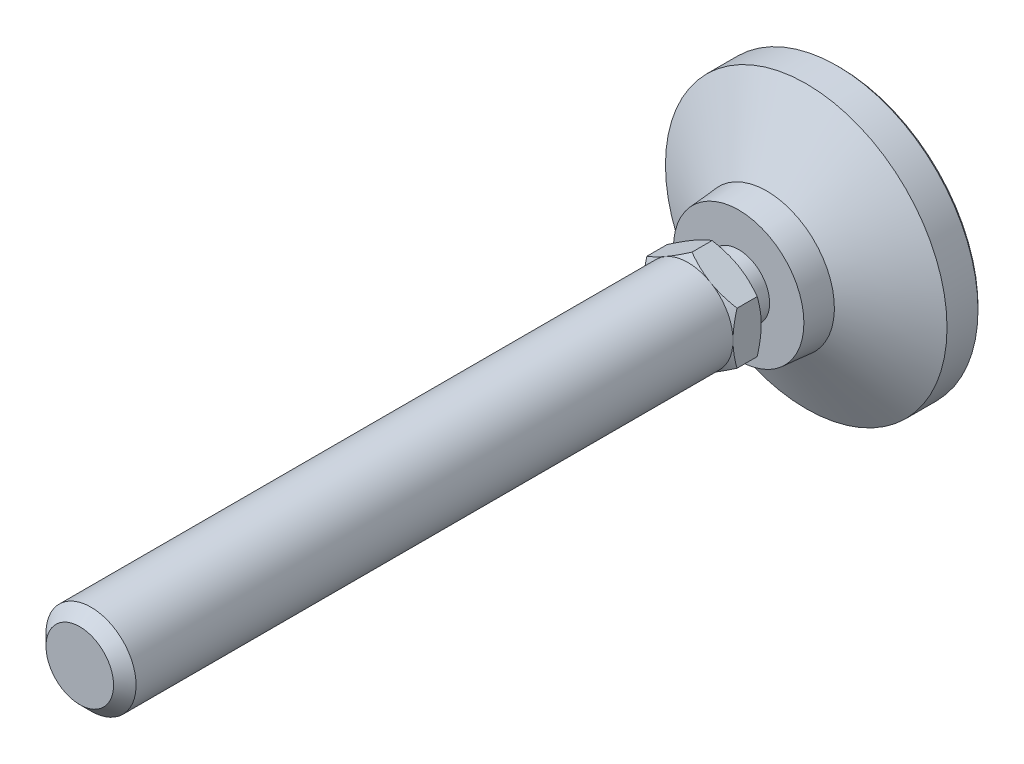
ISO-10303-21;
HEADER;
FILE_DESCRIPTION(('STEP AP214'),'2;1');
FILE_NAME('part.step','',(''),(''),'','','');
FILE_SCHEMA(('AUTOMOTIVE_DESIGN { 1 0 10303 214 1 1 1 1 }'));
ENDSEC;
DATA;
#1=APPLICATION_CONTEXT('core data for automotive mechanical design processes');
#2=APPLICATION_PROTOCOL_DEFINITION('international standard','automotive_design',2000,#1);
#3=PRODUCT_CONTEXT('',#1,'mechanical');
#4=PRODUCT('Part','Part','',(#3));
#5=PRODUCT_RELATED_PRODUCT_CATEGORY('part','',(#4));
#6=PRODUCT_DEFINITION_FORMATION('','',#4);
#7=PRODUCT_DEFINITION_CONTEXT('part definition',#1,'design');
#8=PRODUCT_DEFINITION('design','',#6,#7);
#9=PRODUCT_DEFINITION_SHAPE('','',#8);
#10=(LENGTH_UNIT() NAMED_UNIT(*) SI_UNIT(.MILLI.,.METRE.));
#11=(NAMED_UNIT(*) PLANE_ANGLE_UNIT() SI_UNIT($,.RADIAN.));
#12=(NAMED_UNIT(*) SI_UNIT($,.STERADIAN.) SOLID_ANGLE_UNIT());
#13=UNCERTAINTY_MEASURE_WITH_UNIT(LENGTH_MEASURE(1.E-05),#10,'distance_accuracy_value','');
#14=(GEOMETRIC_REPRESENTATION_CONTEXT(3) GLOBAL_UNCERTAINTY_ASSIGNED_CONTEXT((#13)) GLOBAL_UNIT_ASSIGNED_CONTEXT((#10,
#11,#12)) REPRESENTATION_CONTEXT('',''));
#15=CARTESIAN_POINT('',(0.,0.,0.));
#16=DIRECTION('',(0.,0.,1.));
#17=DIRECTION('',(1.,0.,0.));
#18=AXIS2_PLACEMENT_3D('',#15,#16,#17);
#19=CARTESIAN_POINT('',(0.,-5.50000000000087,21.9999999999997));
#20=DIRECTION('',(0.,0.,-1.));
#21=DIRECTION('',(0.,1.,0.));
#22=AXIS2_PLACEMENT_3D('',#19,#20,#21);
#23=PLANE('',#22);
#24=CARTESIAN_POINT('',(0.,0.,21.9999999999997));
#25=DIRECTION('',(0.,0.,-1.));
#26=DIRECTION('',(0.,1.,0.));
#27=AXIS2_PLACEMENT_3D('',#24,#25,#26);
#28=CIRCLE('',#27,8.00000000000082);
#29=CARTESIAN_POINT('',(-4.00000000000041,6.92820323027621,21.9999999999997));
#30=VERTEX_POINT('',#29);
#31=CARTESIAN_POINT('',(-8.00000000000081,0.,21.9999999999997));
#32=VERTEX_POINT('',#31);
#33=EDGE_CURVE('E9',#30,#32,#28,.F.);
#34=ORIENTED_EDGE('',*,*,#33,.F.);
#35=CARTESIAN_POINT('',(4.,6.92820323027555,21.9999999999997));
#36=VERTEX_POINT('',#35);
#37=EDGE_CURVE('E18',#36,#30,#28,.F.);
#38=ORIENTED_EDGE('',*,*,#37,.F.);
#39=CARTESIAN_POINT('',(8.00000000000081,0.,21.9999999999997));
#40=VERTEX_POINT('',#39);
#41=EDGE_CURVE('E125',#40,#36,#28,.F.);
#42=ORIENTED_EDGE('',*,*,#41,.F.);
#43=CARTESIAN_POINT('',(0.,0.,21.9999999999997));
#44=DIRECTION('',(0.,0.,1.));
#45=DIRECTION('',(0.,-1.,0.));
#46=AXIS2_PLACEMENT_3D('',#43,#44,#45);
#47=CIRCLE('',#46,8.00000000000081);
#48=CARTESIAN_POINT('',(4.00000000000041,-6.92820323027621,21.9999999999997));
#49=VERTEX_POINT('',#48);
#50=EDGE_CURVE('E572',#49,#40,#47,.T.);
#51=ORIENTED_EDGE('',*,*,#50,.F.);
#52=CARTESIAN_POINT('',(-4.00000000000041,-6.92820323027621,21.9999999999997));
#53=VERTEX_POINT('',#52);
#54=EDGE_CURVE('E574',#53,#49,#28,.F.);
#55=ORIENTED_EDGE('',*,*,#54,.F.);
#56=EDGE_CURVE('E23',#32,#53,#28,.F.);
#57=ORIENTED_EDGE('',*,*,#56,.F.);
#58=EDGE_LOOP('',(#34,#38,#42,#51,#55,#57));
#59=FACE_BOUND('',#58,.T.);
#60=CARTESIAN_POINT('',(0.,0.,21.9999999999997));
#61=DIRECTION('',(0.,0.,-1.));
#62=DIRECTION('',(0.,1.,0.));
#63=AXIS2_PLACEMENT_3D('',#60,#61,#62);
#64=CIRCLE('',#63,5.50000000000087);
#65=CARTESIAN_POINT('',(0.,5.50000000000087,21.9999999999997));
#66=VERTEX_POINT('',#65);
#67=EDGE_CURVE('E232',#66,#66,#64,.T.);
#68=ORIENTED_EDGE('',*,*,#67,.F.);
#69=EDGE_LOOP('',(#68));
#70=FACE_BOUND('',#69,.T.);
#71=ADVANCED_FACE('F14',(#59,#70),#23,.T.);
#72=CARTESIAN_POINT('',(0.,0.,-1.));
#73=DIRECTION('',(0.,0.,-1.));
#74=DIRECTION('',(0.,1.,0.));
#75=AXIS2_PLACEMENT_3D('',#72,#73,#74);
#76=CYLINDRICAL_SURFACE('',#75,5.50000000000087);
#77=CARTESIAN_POINT('',(0.,0.,18.));
#78=DIRECTION('',(0.,0.,-1.));
#79=DIRECTION('',(0.,1.,0.));
#80=AXIS2_PLACEMENT_3D('',#77,#78,#79);
#81=CIRCLE('',#80,5.50000000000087);
#82=CARTESIAN_POINT('',(0.,5.50000000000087,18.));
#83=VERTEX_POINT('',#82);
#84=EDGE_CURVE('E235',#83,#83,#81,.T.);
#85=ORIENTED_EDGE('',*,*,#84,.F.);
#86=EDGE_LOOP('',(#85));
#87=FACE_BOUND('',#86,.T.);
#88=ORIENTED_EDGE('',*,*,#67,.T.);
#89=EDGE_LOOP('',(#88));
#90=FACE_BOUND('',#89,.T.);
#91=ADVANCED_FACE('F289',(#87,#90),#76,.T.);
#92=CARTESIAN_POINT('',(0.,-5.50000000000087,18.));
#93=DIRECTION('',(0.,0.,1.));
#94=DIRECTION('',(0.,-1.,0.));
#95=AXIS2_PLACEMENT_3D('',#92,#93,#94);
#96=PLANE('',#95);
#97=ORIENTED_EDGE('',*,*,#84,.T.);
#98=EDGE_LOOP('',(#97));
#99=FACE_BOUND('',#98,.T.);
#100=CARTESIAN_POINT('',(0.,0.,18.));
#101=DIRECTION('',(0.,0.,1.));
#102=DIRECTION('',(0.,-1.,0.));
#103=AXIS2_PLACEMENT_3D('',#100,#101,#102);
#104=CIRCLE('',#103,11.5833333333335);
#105=CARTESIAN_POINT('',(0.,-11.5833333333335,18.));
#106=VERTEX_POINT('',#105);
#107=EDGE_CURVE('E238',#106,#106,#104,.T.);
#108=ORIENTED_EDGE('',*,*,#107,.T.);
#109=EDGE_LOOP('',(#108));
#110=FACE_BOUND('',#109,.T.);
#111=ADVANCED_FACE('F281',(#99,#110),#96,.T.);
#112=CARTESIAN_POINT('',(0.,0.,0.));
#113=DIRECTION('',(0.,0.,-1.));
#114=DIRECTION('',(0.,1.,0.));
#115=AXIS2_PLACEMENT_3D('',#112,#113,#114);
#116=PLANE('',#115);
#117=CARTESIAN_POINT('',(0.,0.,0.));
#118=DIRECTION('',(0.,0.,-1.));
#119=DIRECTION('',(0.,1.,0.));
#120=AXIS2_PLACEMENT_3D('',#117,#118,#119);
#121=CIRCLE('',#120,24.5);
#122=CARTESIAN_POINT('',(0.,24.5,0.));
#123=VERTEX_POINT('',#122);
#124=EDGE_CURVE('E267',#123,#123,#121,.T.);
#125=ORIENTED_EDGE('',*,*,#124,.T.);
#126=EDGE_LOOP('',(#125));
#127=FACE_BOUND('',#126,.T.);
#128=ADVANCED_FACE('F199',(#127),#116,.T.);
#129=CARTESIAN_POINT('',(0.,0.,-1.));
#130=DIRECTION('',(0.,0.,-1.));
#131=DIRECTION('',(0.,1.,0.));
#132=AXIS2_PLACEMENT_3D('',#129,#130,#131);
#133=CYLINDRICAL_SURFACE('',#132,25.);
#134=CARTESIAN_POINT('',(0.,0.,0.500000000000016));
#135=DIRECTION('',(0.,0.,-1.));
#136=DIRECTION('',(0.,1.,0.));
#137=AXIS2_PLACEMENT_3D('',#134,#135,#136);
#138=CIRCLE('',#137,25.);
#139=CARTESIAN_POINT('',(0.,25.,0.500000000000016));
#140=VERTEX_POINT('',#139);
#141=EDGE_CURVE('E126',#140,#140,#138,.F.);
#142=ORIENTED_EDGE('',*,*,#141,.T.);
#143=EDGE_LOOP('',(#142));
#144=FACE_BOUND('',#143,.T.);
#145=CARTESIAN_POINT('',(0.,0.,5.9999999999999));
#146=DIRECTION('',(0.,0.,-1.));
#147=DIRECTION('',(0.,1.,0.));
#148=AXIS2_PLACEMENT_3D('',#145,#146,#147);
#149=CIRCLE('',#148,25.);
#150=CARTESIAN_POINT('',(0.,25.,5.9999999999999));
#151=VERTEX_POINT('',#150);
#152=EDGE_CURVE('E241',#151,#151,#149,.T.);
#153=ORIENTED_EDGE('',*,*,#152,.T.);
#154=EDGE_LOOP('',(#153));
#155=FACE_BOUND('',#154,.T.);
#156=ADVANCED_FACE('F272',(#144,#155),#133,.T.);
#157=CARTESIAN_POINT('',(0.,0.,13.));
#158=DIRECTION('',(0.,0.,-1.));
#159=DIRECTION('',(0.,1.,0.));
#160=AXIS2_PLACEMENT_3D('',#157,#158,#159);
#161=CONICAL_SURFACE('',#160,12.0000000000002,1.07685495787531);
#162=ORIENTED_EDGE('',*,*,#152,.F.);
#163=EDGE_LOOP('',(#162));
#164=FACE_BOUND('',#163,.T.);
#165=CARTESIAN_POINT('',(0.,0.,13.));
#166=DIRECTION('',(0.,0.,-1.));
#167=DIRECTION('',(0.,1.,0.));
#168=AXIS2_PLACEMENT_3D('',#165,#166,#167);
#169=CIRCLE('',#168,12.0000000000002);
#170=CARTESIAN_POINT('',(0.,12.0000000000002,13.));
#171=VERTEX_POINT('',#170);
#172=EDGE_CURVE('E257',#171,#171,#169,.T.);
#173=ORIENTED_EDGE('',*,*,#172,.T.);
#174=EDGE_LOOP('',(#173));
#175=FACE_BOUND('',#174,.T.);
#176=ADVANCED_FACE('F288',(#164,#175),#161,.T.);
#177=CARTESIAN_POINT('',(0.,0.,19.));
#178=DIRECTION('',(0.,0.,-1.));
#179=DIRECTION('',(0.,1.,0.));
#180=AXIS2_PLACEMENT_3D('',#177,#178,#179);
#181=CONICAL_SURFACE('',#180,11.5000000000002,0.0831412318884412);
#182=ORIENTED_EDGE('',*,*,#172,.F.);
#183=EDGE_LOOP('',(#182));
#184=FACE_BOUND('',#183,.T.);
#185=ORIENTED_EDGE('',*,*,#107,.F.);
#186=EDGE_LOOP('',(#185));
#187=FACE_BOUND('',#186,.T.);
#188=ADVANCED_FACE('F277',(#184,#187),#181,.T.);
#189=CARTESIAN_POINT('',(0.,0.,0.));
#190=DIRECTION('',(0.,0.,1.));
#191=DIRECTION('',(0.,-1.,0.));
#192=AXIS2_PLACEMENT_3D('',#189,#190,#191);
#193=CONICAL_SURFACE('',#192,24.5,0.785398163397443);
#194=ORIENTED_EDGE('',*,*,#141,.F.);
#195=EDGE_LOOP('',(#194));
#196=FACE_BOUND('',#195,.T.);
#197=ORIENTED_EDGE('',*,*,#124,.F.);
#198=EDGE_LOOP('',(#197));
#199=FACE_BOUND('',#198,.T.);
#200=ADVANCED_FACE('F16',(#196,#199),#193,.T.);
#201=CARTESIAN_POINT('',(0.,0.,21.9999999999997));
#202=DIRECTION('',(0.,0.,1.));
#203=DIRECTION('',(0.,-1.,0.));
#204=AXIS2_PLACEMENT_3D('',#201,#202,#203);
#205=CONICAL_SURFACE('',#204,8.00000000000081,1.0471975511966);
#206=CARTESIAN_POINT('',(-8.0002,4.61868668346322,22.7145978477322));
#207=CARTESIAN_POINT('',(-7.8243512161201,4.72021302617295,22.6559907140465));
#208=CARTESIAN_POINT('',(-7.64784680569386,4.8221178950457,22.6000434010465));
#209=CARTESIAN_POINT('',(-7.29340453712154,5.02675523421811,22.4942010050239));
#210=CARTESIAN_POINT('',(-7.11546609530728,5.12948804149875,22.4443085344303));
#211=CARTESIAN_POINT('',(-6.57880176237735,5.43933133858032,22.3046927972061));
#212=CARTESIAN_POINT('',(-6.21795741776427,5.64766491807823,22.2252811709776));
#213=CARTESIAN_POINT('',(-5.67796082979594,5.95943209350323,22.1321616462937));
#214=CARTESIAN_POINT('',(-5.50042181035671,6.06193429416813,22.1056345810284));
#215=CARTESIAN_POINT('',(-5.14454088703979,6.26740224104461,22.0611531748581));
#216=CARTESIAN_POINT('',(-4.96619905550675,6.37036794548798,22.0431980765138));
#217=CARTESIAN_POINT('',(-4.6092083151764,6.57647664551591,22.0163156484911));
#218=CARTESIAN_POINT('',(-4.43055998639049,6.67961930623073,22.0073780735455));
#219=CARTESIAN_POINT('',(-4.07309829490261,6.88599991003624,21.9987223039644));
#220=CARTESIAN_POINT('',(-3.89428493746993,6.9892378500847,21.9990038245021));
#221=CARTESIAN_POINT('',(-3.55998663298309,7.18224506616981,22.008145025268));
#222=CARTESIAN_POINT('',(-3.40447809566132,7.27202796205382,22.0158896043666));
#223=CARTESIAN_POINT('',(-3.09382523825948,7.45138347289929,22.0382011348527));
#224=CARTESIAN_POINT('',(-2.93868094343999,7.54095607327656,22.0527685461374));
#225=CARTESIAN_POINT('',(-2.47384868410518,7.80932710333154,22.1063606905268));
#226=CARTESIAN_POINT('',(-2.16498351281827,7.98765049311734,22.1552686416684));
#227=CARTESIAN_POINT('',(-1.54397677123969,8.3461889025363,22.2775394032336));
#228=CARTESIAN_POINT('',(-1.23191445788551,8.52635816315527,22.3514205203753));
#229=CARTESIAN_POINT('',(-0.612443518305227,8.8840098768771,22.5191001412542));
#230=CARTESIAN_POINT('',(-0.305026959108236,9.06149691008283,22.6128592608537));
#231=CARTESIAN_POINT('',(0.000200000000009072,9.23771977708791,22.7145978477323));
#232=B_SPLINE_CURVE_WITH_KNOTS('',3,(#206,#207,#208,#209,#210,#211,#212,#213,#214,#215,#216,
#217,#218,#219,#220,#221,#222,#223,#224,#225,#226,#227,#228,#229,#230,#231),.UNSPECIFIED.,.F.,
.F.,(4,2,2,2,2,2,2,2,2,2,2,2,4),(0.,0.633973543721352,1.26821965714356,2.53934712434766,
3.15934343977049,3.77928496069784,4.39852133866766,5.01773858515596,5.55680239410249,
6.09590254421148,7.17487077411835,8.27776850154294,9.37850115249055),.UNSPECIFIED.);
#233=CARTESIAN_POINT('',(0.,9.23760430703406,22.7145311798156));
#234=VERTEX_POINT('',#233);
#235=EDGE_CURVE('E115',#30,#234,#232,.T.);
#236=ORIENTED_EDGE('',*,*,#235,.T.);
#237=CARTESIAN_POINT('',(-0.000199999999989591,9.2377197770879,22.7145978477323));
#238=CARTESIAN_POINT('',(0.175648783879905,9.13619343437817,22.6559907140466));
#239=CARTESIAN_POINT('',(0.352153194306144,9.03428856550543,22.6000434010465));
#240=CARTESIAN_POINT('',(0.70659546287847,8.82965122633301,22.4942010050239));
#241=CARTESIAN_POINT('',(0.884533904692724,8.72691841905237,22.4443085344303));
#242=CARTESIAN_POINT('',(1.42119823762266,8.4170751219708,22.3046927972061));
#243=CARTESIAN_POINT('',(1.78204258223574,8.20874154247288,22.2252811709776));
#244=CARTESIAN_POINT('',(2.32203917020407,7.89697436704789,22.1321616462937));
#245=CARTESIAN_POINT('',(2.49957818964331,7.79447216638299,22.1056345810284));
#246=CARTESIAN_POINT('',(2.85545911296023,7.58900421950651,22.0611531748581));
#247=CARTESIAN_POINT('',(3.03380094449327,7.48603851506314,22.0431980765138));
#248=CARTESIAN_POINT('',(3.39079168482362,7.2799298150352,22.0163156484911));
#249=CARTESIAN_POINT('',(3.56944001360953,7.17678715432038,22.0073780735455));
#250=CARTESIAN_POINT('',(3.92690170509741,6.97040655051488,21.9987223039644));
#251=CARTESIAN_POINT('',(4.1057150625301,6.86716861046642,21.9990038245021));
#252=CARTESIAN_POINT('',(4.44001336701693,6.67416139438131,22.008145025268));
#253=CARTESIAN_POINT('',(4.5955219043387,6.5843784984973,22.0158896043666));
#254=CARTESIAN_POINT('',(4.90617476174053,6.40502298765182,22.0382011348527));
#255=CARTESIAN_POINT('',(5.06131905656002,6.31545038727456,22.0527685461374));
#256=CARTESIAN_POINT('',(5.52615131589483,6.04707935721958,22.1063606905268));
#257=CARTESIAN_POINT('',(5.83501648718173,5.86875596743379,22.1552686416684));
#258=CARTESIAN_POINT('',(6.45602322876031,5.51021755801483,22.2775394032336));
#259=CARTESIAN_POINT('',(6.76808554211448,5.33004829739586,22.3514205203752));
#260=CARTESIAN_POINT('',(7.38755648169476,4.97239658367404,22.5191001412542));
#261=CARTESIAN_POINT('',(7.69497304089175,4.79490955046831,22.6128592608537));
#262=CARTESIAN_POINT('',(8.0002,4.61868668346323,22.7145978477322));
#263=B_SPLINE_CURVE_WITH_KNOTS('',3,(#237,#238,#239,#240,#241,#242,#243,#244,#245,#246,#247,
#248,#249,#250,#251,#252,#253,#254,#255,#256,#257,#258,#259,#260,#261,#262),.UNSPECIFIED.,.F.,
.F.,(4,2,2,2,2,2,2,2,2,2,2,2,4),(0.,0.633973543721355,1.26821965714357,2.53934712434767,
3.15934343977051,3.77928496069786,4.39852133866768,5.01773858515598,5.55680239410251,
6.09590254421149,7.17487077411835,8.27776850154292,9.37850115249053),.UNSPECIFIED.);
#264=EDGE_CURVE('E121',#234,#36,#263,.T.);
#265=ORIENTED_EDGE('',*,*,#264,.T.);
#266=ORIENTED_EDGE('',*,*,#37,.T.);
#267=EDGE_LOOP('',(#236,#265,#266));
#268=FACE_BOUND('',#267,.T.);
#269=ADVANCED_FACE('F119',(#268),#205,.T.);
#270=CARTESIAN_POINT('',(8.,12.3322472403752,25.8681352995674));
#271=CARTESIAN_POINT('',(8.,11.9834560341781,25.6992409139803));
#272=CARTESIAN_POINT('',(8.,11.6338561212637,25.5319876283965));
#273=CARTESIAN_POINT('',(8.,10.9326085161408,25.2016877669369));
#274=CARTESIAN_POINT('',(8.,10.5809605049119,25.0386418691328));
#275=CARTESIAN_POINT('',(8.,9.8733385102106,24.71684498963));
#276=CARTESIAN_POINT('',(8.,9.51735134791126,24.5581228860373));
#277=CARTESIAN_POINT('',(8.,8.80251953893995,24.2472742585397));
#278=CARTESIAN_POINT('',(8.,8.4436750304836,24.0951474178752));
#279=CARTESIAN_POINT('',(8.,7.71125677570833,23.794595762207));
#280=CARTESIAN_POINT('',(8.,7.33757364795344,23.6464360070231));
#281=CARTESIAN_POINT('',(8.,6.5858090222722,23.3615110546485));
#282=CARTESIAN_POINT('',(8.,6.20772703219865,23.2247471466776));
#283=CARTESIAN_POINT('',(8.,5.44729071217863,22.9662593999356));
#284=CARTESIAN_POINT('',(8.,5.06494707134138,22.8445044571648));
#285=CARTESIAN_POINT('',(8.,4.29479003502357,22.6199888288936));
#286=CARTESIAN_POINT('',(8.,3.90697842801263,22.5172220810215));
#287=CARTESIAN_POINT('',(8.,3.12774306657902,22.3362141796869));
#288=CARTESIAN_POINT('',(8.,2.73635046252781,22.2578425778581));
#289=CARTESIAN_POINT('',(8.,2.14575768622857,22.162010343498));
#290=CARTESIAN_POINT('',(8.,1.94829433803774,22.1336858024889));
#291=CARTESIAN_POINT('',(8.,1.55241167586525,22.0848356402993));
#292=CARTESIAN_POINT('',(8.,1.35399245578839,22.0643092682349));
#293=CARTESIAN_POINT('',(8.,0.959022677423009,22.0317179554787));
#294=CARTESIAN_POINT('',(8.,0.762480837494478,22.0195477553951));
#295=CARTESIAN_POINT('',(8.,0.369058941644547,22.0035243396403));
#296=CARTESIAN_POINT('',(8.,0.172178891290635,21.9996709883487));
#297=CARTESIAN_POINT('',(8.,-0.221568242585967,22.0003730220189));
#298=CARTESIAN_POINT('',(8.,-0.418435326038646,22.0049284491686));
#299=CARTESIAN_POINT('',(8.,-0.811804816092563,22.0223380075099));
#300=CARTESIAN_POINT('',(8.,-1.00830720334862,22.0351925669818));
#301=CARTESIAN_POINT('',(8.,-1.48285355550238,22.0759876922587));
#302=CARTESIAN_POINT('',(8.,-1.76055521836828,22.1079930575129));
#303=CARTESIAN_POINT('',(8.,-2.31383502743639,22.1868149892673));
#304=CARTESIAN_POINT('',(8.,-2.58941287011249,22.2336336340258));
#305=CARTESIAN_POINT('',(8.,-3.41268149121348,22.3938214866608));
#306=CARTESIAN_POINT('',(8.,-3.9565862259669,22.5268914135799));
#307=CARTESIAN_POINT('',(8.,-4.76974931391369,22.7568530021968));
#308=CARTESIAN_POINT('',(8.,-5.0432456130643,22.8396141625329));
#309=CARTESIAN_POINT('',(8.,-5.58758067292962,23.0135354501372));
#310=CARTESIAN_POINT('',(8.,-5.85841941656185,23.1046956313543));
#311=CARTESIAN_POINT('',(8.,-6.39752818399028,23.293968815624));
#312=CARTESIAN_POINT('',(8.,-6.66579906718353,23.3920793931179));
#313=CARTESIAN_POINT('',(8.,-7.20013173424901,23.5941187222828));
#314=CARTESIAN_POINT('',(8.,-7.46619353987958,23.6980474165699));
#315=CARTESIAN_POINT('',(8.,-8.07652277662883,23.9429180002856));
#316=CARTESIAN_POINT('',(8.,-8.42011097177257,24.0855493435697));
#317=CARTESIAN_POINT('',(8.,-9.10450353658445,24.377358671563));
#318=CARTESIAN_POINT('',(8.,-9.44530776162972,24.5265369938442));
#319=CARTESIAN_POINT('',(8.,-10.1246280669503,24.8301770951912));
#320=CARTESIAN_POINT('',(8.,-10.4631436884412,24.9846398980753));
#321=CARTESIAN_POINT('',(8.,-11.1381879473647,25.2978237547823));
#322=CARTESIAN_POINT('',(8.,-11.4747166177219,25.4565447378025));
#323=CARTESIAN_POINT('',(8.,-12.1464125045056,25.7776221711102));
#324=CARTESIAN_POINT('',(8.,-12.4815781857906,25.9399818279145));
#325=CARTESIAN_POINT('',(8.,-13.1504931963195,26.267595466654));
#326=CARTESIAN_POINT('',(8.,-13.4842425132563,26.4328494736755));
#327=CARTESIAN_POINT('',(8.,-14.4837079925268,26.9322149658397));
#328=CARTESIAN_POINT('',(8.,-15.1476278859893,27.2699232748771));
#329=CARTESIAN_POINT('',(8.,-16.1145058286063,27.7680268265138));
#330=CARTESIAN_POINT('',(8.,-16.4188574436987,27.9257339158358));
#331=CARTESIAN_POINT('',(8.,-17.0268963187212,28.2424121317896));
#332=CARTESIAN_POINT('',(8.,-17.3305835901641,28.4013832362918));
#333=CARTESIAN_POINT('',(8.,-18.2408042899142,28.8799514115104));
#334=CARTESIAN_POINT('',(8.,-18.8464737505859,29.2011915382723));
#335=CARTESIAN_POINT('',(8.,-20.0546327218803,29.846289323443));
#336=CARTESIAN_POINT('',(8.,-20.6571263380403,30.1701393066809));
#337=CARTESIAN_POINT('',(8.,-21.8606424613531,30.8204896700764));
#338=CARTESIAN_POINT('',(8.,-22.4616650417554,31.146989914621));
#339=CARTESIAN_POINT('',(8.,-23.0621408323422,31.4744863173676));
#340=B_SPLINE_CURVE_WITH_KNOTS('',3,(#270,#271,#272,#273,#274,#275,#276,#277,#278,#279,#280,
#281,#282,#283,#284,#285,#286,#287,#288,#289,#290,#291,#292,#293,#294,#295,#296,#297,#298,#299,
#300,#301,#302,#303,#304,#305,#306,#307,#308,#309,#310,#311,#312,#313,#314,#315,#316,#317,#318,
#319,#320,#321,#322,#323,#324,#325,#326,#327,#328,#329,#330,#331,#332,#333,#334,#335,#336,#337,
#338,#339),.UNSPECIFIED.,.F.,.F.,(4,2,2,2,2,2,2,2,2,2,2,2,2,2,2,2,2,2,2,2,2,2,2,2,2,2,2,2,2,2,2,
2,2,2,4),(0.,1.1626088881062,2.32540398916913,3.49465624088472,4.66385227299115,
5.86965733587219,7.07559862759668,8.27899718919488,9.48201087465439,10.6784765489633,
11.2768001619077,11.8750661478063,12.4656504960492,13.0562252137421,13.6468028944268,
14.237411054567,15.0755555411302,15.9138176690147,17.5913055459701,18.4484686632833,
19.3056372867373,20.1625082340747,21.0193707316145,22.1353317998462,23.2513504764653,
24.3675866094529,25.4838041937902,26.601047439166,27.7183003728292,29.9528521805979,
30.9812056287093,32.0095411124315,34.0662892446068,36.1183292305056,38.1702648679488),.UNSPECIFIED.);
#341=CARTESIAN_POINT('',(8.,4.61880215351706,22.7145311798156));
#342=VERTEX_POINT('',#341);
#343=EDGE_CURVE('E134',#342,#40,#340,.T.);
#344=ORIENTED_EDGE('',*,*,#343,.T.);
#345=ORIENTED_EDGE('',*,*,#41,.T.);
#346=EDGE_CURVE('E171',#36,#342,#263,.T.);
#347=ORIENTED_EDGE('',*,*,#346,.T.);
#348=EDGE_LOOP('',(#344,#345,#347));
#349=FACE_BOUND('',#348,.T.);
#350=ADVANCED_FACE('F159',(#349),#205,.T.);
#351=CARTESIAN_POINT('',(8.0002,-4.61868668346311,22.7145978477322));
#352=CARTESIAN_POINT('',(7.82435121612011,-4.72021302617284,22.6559907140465));
#353=CARTESIAN_POINT('',(7.64784680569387,-4.82211789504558,22.6000434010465));
#354=CARTESIAN_POINT('',(7.29340453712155,-5.02675523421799,22.4942010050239));
#355=CARTESIAN_POINT('',(7.1154660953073,-5.12948804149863,22.4443085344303));
#356=CARTESIAN_POINT('',(6.57880176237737,-5.4393313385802,22.3046927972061));
#357=CARTESIAN_POINT('',(6.21795741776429,-5.64766491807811,22.2252811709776));
#358=CARTESIAN_POINT('',(5.67796082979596,-5.95943209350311,22.1321616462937));
#359=CARTESIAN_POINT('',(5.50042181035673,-6.06193429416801,22.1056345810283));
#360=CARTESIAN_POINT('',(5.14454088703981,-6.26740224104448,22.0611531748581));
#361=CARTESIAN_POINT('',(4.96619905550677,-6.37036794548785,22.0431980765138));
#362=CARTESIAN_POINT('',(4.60920831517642,-6.57647664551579,22.0163156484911));
#363=CARTESIAN_POINT('',(4.43055998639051,-6.67961930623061,22.0073780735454));
#364=CARTESIAN_POINT('',(4.07309829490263,-6.88599991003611,21.9987223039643));
#365=CARTESIAN_POINT('',(3.89428493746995,-6.98923785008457,21.999003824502));
#366=CARTESIAN_POINT('',(3.55998663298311,-7.18224506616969,22.008145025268));
#367=CARTESIAN_POINT('',(3.40447809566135,-7.27202796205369,22.0158896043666));
#368=CARTESIAN_POINT('',(3.09382523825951,-7.45138347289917,22.0382011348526));
#369=CARTESIAN_POINT('',(2.93868094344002,-7.54095607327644,22.0527685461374));
#370=CARTESIAN_POINT('',(2.4738486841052,-7.80932710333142,22.1063606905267));
#371=CARTESIAN_POINT('',(2.16498351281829,-7.98765049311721,22.1552686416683));
#372=CARTESIAN_POINT('',(1.54397677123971,-8.34618890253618,22.2775394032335));
#373=CARTESIAN_POINT('',(1.23191445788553,-8.52635816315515,22.3514205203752));
#374=CARTESIAN_POINT('',(0.612443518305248,-8.88400987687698,22.5191001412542));
#375=CARTESIAN_POINT('',(0.305026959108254,-9.06149691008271,22.6128592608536));
#376=CARTESIAN_POINT('',(-0.000199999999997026,-9.23771977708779,22.7145978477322));
#377=B_SPLINE_CURVE_WITH_KNOTS('',3,(#351,#352,#353,#354,#355,#356,#357,#358,#359,#360,#361,
#362,#363,#364,#365,#366,#367,#368,#369,#370,#371,#372,#373,#374,#375,#376),.UNSPECIFIED.,.F.,
.F.,(4,2,2,2,2,2,2,2,2,2,2,2,4),(0.,0.633973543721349,1.26821965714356,2.53934712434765,
3.15934343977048,3.77928496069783,4.39852133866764,5.01773858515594,5.55680239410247,
6.09590254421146,7.17487077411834,8.27776850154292,9.37850115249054),.UNSPECIFIED.);
#378=CARTESIAN_POINT('',(8.,-4.61880215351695,22.7145311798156));
#379=VERTEX_POINT('',#378);
#380=EDGE_CURVE('E149',#379,#49,#377,.T.);
#381=ORIENTED_EDGE('',*,*,#380,.T.);
#382=ORIENTED_EDGE('',*,*,#50,.T.);
#383=EDGE_CURVE('E114',#40,#379,#340,.T.);
#384=ORIENTED_EDGE('',*,*,#383,.T.);
#385=EDGE_LOOP('',(#381,#382,#384));
#386=FACE_BOUND('',#385,.T.);
#387=ADVANCED_FACE('F163',(#386),#205,.T.);
#388=CARTESIAN_POINT('',(0.000200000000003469,-9.23771977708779,22.7145978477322));
#389=CARTESIAN_POINT('',(-0.175648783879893,-9.13619343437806,22.6559907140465));
#390=CARTESIAN_POINT('',(-0.352153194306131,-9.03428856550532,22.6000434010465));
#391=CARTESIAN_POINT('',(-0.706595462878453,-8.8296512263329,22.4942010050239));
#392=CARTESIAN_POINT('',(-0.884533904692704,-8.72691841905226,22.4443085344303));
#393=CARTESIAN_POINT('',(-1.42119823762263,-8.4170751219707,22.3046927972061));
#394=CARTESIAN_POINT('',(-1.78204258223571,-8.20874154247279,22.2252811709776));
#395=CARTESIAN_POINT('',(-2.32203917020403,-7.89697436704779,22.1321616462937));
#396=CARTESIAN_POINT('',(-2.49957818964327,-7.79447216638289,22.1056345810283));
#397=CARTESIAN_POINT('',(-2.85545911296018,-7.58900421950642,22.0611531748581));
#398=CARTESIAN_POINT('',(-3.03380094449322,-7.48603851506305,22.0431980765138));
#399=CARTESIAN_POINT('',(-3.39079168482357,-7.27992981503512,22.0163156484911));
#400=CARTESIAN_POINT('',(-3.56944001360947,-7.1767871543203,22.0073780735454));
#401=CARTESIAN_POINT('',(-3.92690170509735,-6.97040655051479,21.9987223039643));
#402=CARTESIAN_POINT('',(-4.10571506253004,-6.86716861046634,21.999003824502));
#403=CARTESIAN_POINT('',(-4.44001336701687,-6.67416139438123,22.008145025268));
#404=CARTESIAN_POINT('',(-4.59552190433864,-6.58437849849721,22.0158896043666));
#405=CARTESIAN_POINT('',(-4.90617476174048,-6.40502298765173,22.0382011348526));
#406=CARTESIAN_POINT('',(-5.06131905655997,-6.31545038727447,22.0527685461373));
#407=CARTESIAN_POINT('',(-5.52615131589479,-6.04707935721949,22.1063606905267));
#408=CARTESIAN_POINT('',(-5.8350164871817,-5.86875596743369,22.1552686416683));
#409=CARTESIAN_POINT('',(-6.45602322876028,-5.51021755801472,22.2775394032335));
#410=CARTESIAN_POINT('',(-6.76808554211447,-5.33004829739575,22.3514205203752));
#411=CARTESIAN_POINT('',(-7.38755648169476,-4.97239658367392,22.5191001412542));
#412=CARTESIAN_POINT('',(-7.69497304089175,-4.79490955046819,22.6128592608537));
#413=CARTESIAN_POINT('',(-8.0002,-4.61868668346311,22.7145978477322));
#414=B_SPLINE_CURVE_WITH_KNOTS('',3,(#388,#389,#390,#391,#392,#393,#394,#395,#396,#397,#398,
#399,#400,#401,#402,#403,#404,#405,#406,#407,#408,#409,#410,#411,#412,#413),.UNSPECIFIED.,.F.,
.F.,(4,2,2,2,2,2,2,2,2,2,2,2,4),(0.,0.633973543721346,1.26821965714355,2.53934712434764,
3.15934343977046,3.77928496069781,4.39852133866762,5.01773858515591,5.55680239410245,
6.09590254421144,7.17487077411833,8.27776850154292,9.37850115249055),.UNSPECIFIED.);
#415=CARTESIAN_POINT('',(0.,-9.23760430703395,22.7145311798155));
#416=VERTEX_POINT('',#415);
#417=EDGE_CURVE('E37',#416,#53,#414,.T.);
#418=ORIENTED_EDGE('',*,*,#417,.T.);
#419=ORIENTED_EDGE('',*,*,#54,.T.);
#420=EDGE_CURVE('E516',#49,#416,#377,.T.);
#421=ORIENTED_EDGE('',*,*,#420,.T.);
#422=EDGE_LOOP('',(#418,#419,#421));
#423=FACE_BOUND('',#422,.T.);
#424=ADVANCED_FACE('F165',(#423),#205,.T.);
#425=CARTESIAN_POINT('',(-8.,-4.61880215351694,22.7145311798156));
#426=VERTEX_POINT('',#425);
#427=EDGE_CURVE('E186',#53,#426,#414,.T.);
#428=ORIENTED_EDGE('',*,*,#427,.T.);
#429=CARTESIAN_POINT('',(-8.,12.3322472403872,25.8681352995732));
#430=CARTESIAN_POINT('',(-8.,11.9834560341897,25.6992409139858));
#431=CARTESIAN_POINT('',(-8.00000000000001,11.6338561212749,25.5319876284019));
#432=CARTESIAN_POINT('',(-8.00000000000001,10.9326085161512,25.2016877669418));
#433=CARTESIAN_POINT('',(-8.00000000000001,10.5809605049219,25.0386418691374));
#434=CARTESIAN_POINT('',(-8.00000000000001,9.87333851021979,24.7168449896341));
#435=CARTESIAN_POINT('',(-8.00000000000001,9.51735134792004,24.5581228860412));
#436=CARTESIAN_POINT('',(-8.00000000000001,8.80251953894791,24.2472742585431));
#437=CARTESIAN_POINT('',(-8.00000000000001,8.44367503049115,24.0951474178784));
#438=CARTESIAN_POINT('',(-8.00000000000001,7.71125677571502,23.7945957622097));
#439=CARTESIAN_POINT('',(-8.00000000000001,7.33757364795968,23.6464360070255));
#440=CARTESIAN_POINT('',(-8.00000000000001,6.58580902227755,23.3615110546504));
#441=CARTESIAN_POINT('',(-8.,6.20772703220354,23.2247471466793));
#442=CARTESIAN_POINT('',(-8.,5.44729071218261,22.9662593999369));
#443=CARTESIAN_POINT('',(-8.00000000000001,5.0649470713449,22.8445044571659));
#444=CARTESIAN_POINT('',(-8.,4.29479003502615,22.6199888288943));
#445=CARTESIAN_POINT('',(-8.,3.90697842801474,22.5172220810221));
#446=CARTESIAN_POINT('',(-8.,3.12774306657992,22.3362141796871));
#447=CARTESIAN_POINT('',(-8.,2.73635046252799,22.2578425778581));
#448=CARTESIAN_POINT('',(-8.,2.14575768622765,22.1620103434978));
#449=CARTESIAN_POINT('',(-8.,1.94829433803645,22.1336858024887));
#450=CARTESIAN_POINT('',(-8.,1.55241167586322,22.084835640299));
#451=CARTESIAN_POINT('',(-8.,1.35399245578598,22.0643092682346));
#452=CARTESIAN_POINT('',(-8.,0.959022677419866,22.0317179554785));
#453=CARTESIAN_POINT('',(-8.,0.762480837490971,22.0195477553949));
#454=CARTESIAN_POINT('',(-8.,0.369058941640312,22.0035243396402));
#455=CARTESIAN_POINT('',(-8.,0.172178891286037,21.9996709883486));
#456=CARTESIAN_POINT('',(-8.,-0.221568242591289,22.000373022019));
#457=CARTESIAN_POINT('',(-8.,-0.418435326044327,22.0049284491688));
#458=CARTESIAN_POINT('',(-8.,-0.81180481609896,22.0223380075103));
#459=CARTESIAN_POINT('',(-8.,-1.00830720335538,22.0351925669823));
#460=CARTESIAN_POINT('',(-8.,-1.4828535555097,22.0759876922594));
#461=CARTESIAN_POINT('',(-8.,-1.7605552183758,22.1079930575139));
#462=CARTESIAN_POINT('',(-8.,-2.31383502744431,22.1868149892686));
#463=CARTESIAN_POINT('',(-8.,-2.58941287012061,22.2336336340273));
#464=CARTESIAN_POINT('',(-8.,-3.41268149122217,22.3938214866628));
#465=CARTESIAN_POINT('',(-8.,-3.95658622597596,22.5268914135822));
#466=CARTESIAN_POINT('',(-8.,-4.7697493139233,22.7568530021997));
#467=CARTESIAN_POINT('',(-8.,-5.04324561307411,22.8396141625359));
#468=CARTESIAN_POINT('',(-8.,-5.58758067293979,23.0135354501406));
#469=CARTESIAN_POINT('',(-8.,-5.85841941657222,23.1046956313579));
#470=CARTESIAN_POINT('',(-8.,-6.39752818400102,23.2939688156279));
#471=CARTESIAN_POINT('',(-8.,-6.66579906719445,23.3920793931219));
#472=CARTESIAN_POINT('',(-8.,-7.20013173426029,23.5941187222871));
#473=CARTESIAN_POINT('',(-8.,-7.46619353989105,23.6980474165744));
#474=CARTESIAN_POINT('',(-8.,-8.07652277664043,23.9429180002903));
#475=CARTESIAN_POINT('',(-8.,-8.42011097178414,24.0855493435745));
#476=CARTESIAN_POINT('',(-8.,-9.10450353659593,24.377358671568));
#477=CARTESIAN_POINT('',(-8.,-9.44530776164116,24.5265369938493));
#478=CARTESIAN_POINT('',(-8.,-10.1246280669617,24.8301770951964));
#479=CARTESIAN_POINT('',(-8.,-10.4631436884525,24.9846398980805));
#480=CARTESIAN_POINT('',(-8.,-11.138187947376,25.2978237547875));
#481=CARTESIAN_POINT('',(-8.,-11.4747166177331,25.4565447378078));
#482=CARTESIAN_POINT('',(-8.,-12.1464125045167,25.7776221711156));
#483=CARTESIAN_POINT('',(-8.,-12.4815781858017,25.9399818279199));
#484=CARTESIAN_POINT('',(-8.,-13.1504931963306,26.2675954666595));
#485=CARTESIAN_POINT('',(-8.,-13.4842425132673,26.432849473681));
#486=CARTESIAN_POINT('',(-8.,-14.4837079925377,26.9322149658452));
#487=CARTESIAN_POINT('',(-8.,-15.1476278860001,27.2699232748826));
#488=CARTESIAN_POINT('',(-8.,-16.1145058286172,27.7680268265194));
#489=CARTESIAN_POINT('',(-7.99999999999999,-16.4188574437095,27.9257339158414));
#490=CARTESIAN_POINT('',(-7.99999999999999,-17.026896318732,28.2424121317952));
#491=CARTESIAN_POINT('',(-7.99999999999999,-17.3305835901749,28.4013832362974));
#492=CARTESIAN_POINT('',(-7.99999999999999,-18.240804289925,28.8799514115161));
#493=CARTESIAN_POINT('',(-7.99999999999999,-18.8464737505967,29.201191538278));
#494=CARTESIAN_POINT('',(-7.99999999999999,-20.0546327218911,29.8462893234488));
#495=CARTESIAN_POINT('',(-7.99999999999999,-20.6571263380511,30.1701393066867));
#496=CARTESIAN_POINT('',(-7.99999999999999,-21.8606424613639,30.8204896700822));
#497=CARTESIAN_POINT('',(-7.99999999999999,-22.4616650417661,31.1469899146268));
#498=CARTESIAN_POINT('',(-8.,-23.0621408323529,31.4744863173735));
#499=B_SPLINE_CURVE_WITH_KNOTS('',3,(#429,#430,#431,#432,#433,#434,#435,#436,#437,#438,#439,
#440,#441,#442,#443,#444,#445,#446,#447,#448,#449,#450,#451,#452,#453,#454,#455,#456,#457,#458,
#459,#460,#461,#462,#463,#464,#465,#466,#467,#468,#469,#470,#471,#472,#473,#474,#475,#476,#477,
#478,#479,#480,#481,#482,#483,#484,#485,#486,#487,#488,#489,#490,#491,#492,#493,#494,#495,#496,
#497,#498),.UNSPECIFIED.,.F.,.F.,(4,2,2,2,2,2,2,2,2,2,2,2,2,2,2,2,2,2,2,2,2,2,2,2,2,2,2,2,2,2,2,
2,2,2,4),(0.,1.1626088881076,2.32540398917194,3.49465624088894,4.66385227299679,
5.86965733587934,7.07559862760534,8.27899718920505,9.48201087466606,10.6784765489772,
11.2768001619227,11.8750661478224,12.4656504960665,13.0562252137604,13.6468028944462,
14.2374110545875,15.0755555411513,15.9138176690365,17.5913055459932,18.4484686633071,
19.3056372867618,20.1625082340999,21.0193707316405,22.135331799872,23.2513504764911,
24.3675866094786,25.4838041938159,26.6010474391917,27.7183003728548,29.9528521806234,
30.9812056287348,32.0095411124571,34.0662892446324,36.1183292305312,38.1702648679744),.UNSPECIFIED.);
#500=EDGE_CURVE('E30',#426,#32,#499,.F.);
#501=ORIENTED_EDGE('',*,*,#500,.T.);
#502=ORIENTED_EDGE('',*,*,#56,.T.);
#503=EDGE_LOOP('',(#428,#501,#502));
#504=FACE_BOUND('',#503,.T.);
#505=ADVANCED_FACE('F382',(#504),#205,.T.);
#506=CARTESIAN_POINT('',(-8.,4.61880215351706,22.7145311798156));
#507=VERTEX_POINT('',#506);
#508=EDGE_CURVE('E109',#32,#507,#499,.F.);
#509=ORIENTED_EDGE('',*,*,#508,.T.);
#510=EDGE_CURVE('E103',#507,#30,#232,.T.);
#511=ORIENTED_EDGE('',*,*,#510,.T.);
#512=ORIENTED_EDGE('',*,*,#33,.T.);
#513=EDGE_LOOP('',(#509,#511,#512));
#514=FACE_BOUND('',#513,.T.);
#515=ADVANCED_FACE('F105',(#514),#205,.T.);
#516=CARTESIAN_POINT('',(0.,0.,135.));
#517=DIRECTION('',(0.,0.,-1.));
#518=DIRECTION('',(0.,1.,0.));
#519=AXIS2_PLACEMENT_3D('',#516,#517,#518);
#520=PLANE('',#519);
#521=CARTESIAN_POINT('',(0.,0.,135.));
#522=DIRECTION('',(0.,0.,-1.));
#523=DIRECTION('',(0.,1.,0.));
#524=AXIS2_PLACEMENT_3D('',#521,#522,#523);
#525=CIRCLE('',#524,6.00000000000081);
#526=CARTESIAN_POINT('',(0.,6.00000000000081,135.));
#527=VERTEX_POINT('',#526);
#528=EDGE_CURVE('E229',#527,#527,#525,.T.);
#529=ORIENTED_EDGE('',*,*,#528,.F.);
#530=EDGE_LOOP('',(#529));
#531=FACE_BOUND('',#530,.T.);
#532=ADVANCED_FACE('F300',(#531),#520,.F.);
#533=CARTESIAN_POINT('',(0.,0.,135.));
#534=DIRECTION('',(0.,0.,-1.));
#535=DIRECTION('',(0.,1.,0.));
#536=AXIS2_PLACEMENT_3D('',#533,#534,#535);
#537=CONICAL_SURFACE('',#536,6.00000000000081,0.785398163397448);
#538=CARTESIAN_POINT('',(0.,0.,133.));
#539=DIRECTION('',(0.,0.,-1.));
#540=DIRECTION('',(0.,1.,0.));
#541=AXIS2_PLACEMENT_3D('',#538,#539,#540);
#542=CIRCLE('',#541,8.00000000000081);
#543=CARTESIAN_POINT('',(0.,8.00000000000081,133.));
#544=VERTEX_POINT('',#543);
#545=EDGE_CURVE('E226',#544,#544,#542,.T.);
#546=ORIENTED_EDGE('',*,*,#545,.F.);
#547=EDGE_LOOP('',(#546));
#548=FACE_BOUND('',#547,.T.);
#549=ORIENTED_EDGE('',*,*,#528,.T.);
#550=EDGE_LOOP('',(#549));
#551=FACE_BOUND('',#550,.T.);
#552=ADVANCED_FACE('F302',(#548,#551),#537,.T.);
#553=CARTESIAN_POINT('',(0.,0.,-1.));
#554=DIRECTION('',(0.,0.,-1.));
#555=DIRECTION('',(0.,1.,0.));
#556=AXIS2_PLACEMENT_3D('',#553,#554,#555);
#557=CYLINDRICAL_SURFACE('',#556,8.00000000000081);
#558=CARTESIAN_POINT('',(0.,0.,27.));
#559=DIRECTION('',(0.,0.,1.));
#560=DIRECTION('',(0.,-1.,0.));
#561=AXIS2_PLACEMENT_3D('',#558,#559,#560);
#562=CIRCLE('',#561,8.00000000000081);
#563=CARTESIAN_POINT('',(-4.00000000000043,-6.9282032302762,27.));
#564=VERTEX_POINT('',#563);
#565=CARTESIAN_POINT('',(4.00000000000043,-6.9282032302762,27.));
#566=VERTEX_POINT('',#565);
#567=EDGE_CURVE('E260',#564,#566,#562,.T.);
#568=ORIENTED_EDGE('',*,*,#567,.T.);
#569=CARTESIAN_POINT('',(0.,0.,27.));
#570=DIRECTION('',(0.,0.,1.));
#571=DIRECTION('',(0.,-1.,0.));
#572=AXIS2_PLACEMENT_3D('',#569,#570,#571);
#573=CIRCLE('',#572,8.00000000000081);
#574=CARTESIAN_POINT('',(8.00000000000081,0.,27.));
#575=VERTEX_POINT('',#574);
#576=EDGE_CURVE('E512',#566,#575,#573,.T.);
#577=ORIENTED_EDGE('',*,*,#576,.T.);
#578=CARTESIAN_POINT('',(4.,6.92820323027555,27.));
#579=VERTEX_POINT('',#578);
#580=EDGE_CURVE('E264',#575,#579,#562,.T.);
#581=ORIENTED_EDGE('',*,*,#580,.T.);
#582=CARTESIAN_POINT('',(-4.00000000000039,6.92820323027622,27.));
#583=VERTEX_POINT('',#582);
#584=EDGE_CURVE('E560',#579,#583,#562,.T.);
#585=ORIENTED_EDGE('',*,*,#584,.T.);
#586=CARTESIAN_POINT('',(-8.00000000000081,0.,27.));
#587=VERTEX_POINT('',#586);
#588=EDGE_CURVE('E565',#583,#587,#562,.T.);
#589=ORIENTED_EDGE('',*,*,#588,.T.);
#590=EDGE_CURVE('E263',#587,#564,#562,.T.);
#591=ORIENTED_EDGE('',*,*,#590,.T.);
#592=EDGE_LOOP('',(#568,#577,#581,#585,#589,#591));
#593=FACE_BOUND('',#592,.T.);
#594=ORIENTED_EDGE('',*,*,#545,.T.);
#595=EDGE_LOOP('',(#594));
#596=FACE_BOUND('',#595,.T.);
#597=ADVANCED_FACE('F305',(#593,#596),#557,.T.);
#598=CARTESIAN_POINT('',(0.,0.,25.6920272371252));
#599=DIRECTION('',(0.,0.,-1.));
#600=DIRECTION('',(0.,1.,0.));
#601=AXIS2_PLACEMENT_3D('',#598,#599,#600);
#602=CONICAL_SURFACE('',#601,10.2654752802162,1.0471975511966);
#603=CARTESIAN_POINT('',(0.000200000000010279,9.23771977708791,26.2854021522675));
#604=CARTESIAN_POINT('',(-0.175648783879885,9.13619343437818,26.3440092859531));
#605=CARTESIAN_POINT('',(-0.352153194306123,9.03428856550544,26.3999565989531));
#606=CARTESIAN_POINT('',(-0.70659546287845,8.82965122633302,26.5057989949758));
#607=CARTESIAN_POINT('',(-0.884533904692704,8.72691841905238,26.5556914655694));
#608=CARTESIAN_POINT('',(-1.42119823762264,8.41707512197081,26.6953072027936));
#609=CARTESIAN_POINT('',(-1.78204258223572,8.20874154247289,26.7747188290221));
#610=CARTESIAN_POINT('',(-2.32203917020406,7.8969743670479,26.867838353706));
#611=CARTESIAN_POINT('',(-2.49957818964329,7.79447216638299,26.8943654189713));
#612=CARTESIAN_POINT('',(-2.85545911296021,7.58900421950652,26.9388468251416));
#613=CARTESIAN_POINT('',(-3.03380094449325,7.48603851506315,26.9568019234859));
#614=CARTESIAN_POINT('',(-3.39079168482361,7.27992981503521,26.9836843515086));
#615=CARTESIAN_POINT('',(-3.56944001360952,7.17678715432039,26.9926219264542));
#616=CARTESIAN_POINT('',(-3.9269017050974,6.97040655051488,27.0012776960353));
#617=CARTESIAN_POINT('',(-4.10571506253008,6.86716861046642,27.0009961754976));
#618=CARTESIAN_POINT('',(-4.44001336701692,6.67416139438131,26.9918549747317));
#619=CARTESIAN_POINT('',(-4.59552190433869,6.5843784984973,26.9841103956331));
#620=CARTESIAN_POINT('',(-4.90617476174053,6.40502298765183,26.961798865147));
#621=CARTESIAN_POINT('',(-5.06131905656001,6.31545038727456,26.9472314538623));
#622=CARTESIAN_POINT('',(-5.52615131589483,6.04707935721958,26.8936393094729));
#623=CARTESIAN_POINT('',(-5.83501648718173,5.86875596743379,26.8447313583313));
#624=CARTESIAN_POINT('',(-6.4560232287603,5.51021755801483,26.7224605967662));
#625=CARTESIAN_POINT('',(-6.76808554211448,5.33004829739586,26.6485794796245));
#626=CARTESIAN_POINT('',(-7.38755648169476,4.97239658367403,26.4808998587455));
#627=CARTESIAN_POINT('',(-7.69497304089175,4.7949095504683,26.387140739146));
#628=CARTESIAN_POINT('',(-8.0002,4.61868668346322,26.2854021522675));
#629=B_SPLINE_CURVE_WITH_KNOTS('',3,(#603,#604,#605,#606,#607,#608,#609,#610,#611,#612,#613,
#614,#615,#616,#617,#618,#619,#620,#621,#622,#623,#624,#625,#626,#627,#628),.UNSPECIFIED.,.F.,
.F.,(4,2,2,2,2,2,2,2,2,2,2,2,4),(0.,0.633973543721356,1.26821965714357,2.53934712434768,
3.15934343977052,3.77928496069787,4.39852133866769,5.01773858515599,5.55680239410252,
6.09590254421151,7.17487077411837,8.27776850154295,9.37850115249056),.UNSPECIFIED.);
#630=CARTESIAN_POINT('',(-8.,4.61880215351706,26.2854688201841));
#631=VERTEX_POINT('',#630);
#632=EDGE_CURVE('E219',#583,#631,#629,.T.);
#633=ORIENTED_EDGE('',*,*,#632,.T.);
#634=CARTESIAN_POINT('',(-8.,12.3322472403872,23.1318647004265));
#635=CARTESIAN_POINT('',(-8.,11.9834560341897,23.3007590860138));
#636=CARTESIAN_POINT('',(-8.00000000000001,11.6338561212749,23.4680123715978));
#637=CARTESIAN_POINT('',(-8.00000000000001,10.9326085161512,23.7983122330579));
#638=CARTESIAN_POINT('',(-8.00000000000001,10.5809605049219,23.9613581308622));
#639=CARTESIAN_POINT('',(-8.00000000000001,9.87333851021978,24.2831550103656));
#640=CARTESIAN_POINT('',(-8.00000000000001,9.51735134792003,24.4418771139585));
#641=CARTESIAN_POINT('',(-8.00000000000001,8.80251953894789,24.7527257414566));
#642=CARTESIAN_POINT('',(-8.00000000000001,8.44367503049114,24.9048525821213));
#643=CARTESIAN_POINT('',(-8.00000000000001,7.71125677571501,25.20540423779));
#644=CARTESIAN_POINT('',(-8.00000000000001,7.33757364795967,25.3535639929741));
#645=CARTESIAN_POINT('',(-8.00000000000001,6.58580902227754,25.6384889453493));
#646=CARTESIAN_POINT('',(-8.,6.20772703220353,25.7752528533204));
#647=CARTESIAN_POINT('',(-8.,5.44729071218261,26.0337406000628));
#648=CARTESIAN_POINT('',(-8.00000000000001,5.0649470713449,26.1554955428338));
#649=CARTESIAN_POINT('',(-8.,4.29479003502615,26.3800111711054));
#650=CARTESIAN_POINT('',(-8.,3.90697842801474,26.4827779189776));
#651=CARTESIAN_POINT('',(-8.,3.12774306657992,26.6637858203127));
#652=CARTESIAN_POINT('',(-8.,2.73635046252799,26.7421574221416));
#653=CARTESIAN_POINT('',(-8.,2.14575768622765,26.8379896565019));
#654=CARTESIAN_POINT('',(-8.,1.94829433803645,26.866314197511));
#655=CARTESIAN_POINT('',(-8.,1.55241167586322,26.9151643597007));
#656=CARTESIAN_POINT('',(-8.,1.35399245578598,26.9356907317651));
#657=CARTESIAN_POINT('',(-8.,0.959022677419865,26.9682820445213));
#658=CARTESIAN_POINT('',(-8.,0.762480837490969,26.9804522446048));
#659=CARTESIAN_POINT('',(-8.,0.36905894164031,26.9964756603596));
#660=CARTESIAN_POINT('',(-8.,0.172178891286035,27.0003290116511));
#661=CARTESIAN_POINT('',(-8.,-0.221568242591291,26.9996269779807));
#662=CARTESIAN_POINT('',(-8.,-0.41843532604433,26.9950715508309));
#663=CARTESIAN_POINT('',(-8.,-0.811804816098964,26.9776619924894));
#664=CARTESIAN_POINT('',(-8.,-1.00830720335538,26.9648074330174));
#665=CARTESIAN_POINT('',(-8.,-1.4828535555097,26.9240123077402));
#666=CARTESIAN_POINT('',(-8.,-1.76055521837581,26.8920069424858));
#667=CARTESIAN_POINT('',(-8.,-2.31383502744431,26.8131850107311));
#668=CARTESIAN_POINT('',(-8.,-2.58941287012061,26.7663663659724));
#669=CARTESIAN_POINT('',(-8.,-3.41268149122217,26.6061785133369));
#670=CARTESIAN_POINT('',(-8.,-3.95658622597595,26.4731085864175));
#671=CARTESIAN_POINT('',(-8.,-4.76974931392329,26.2431469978));
#672=CARTESIAN_POINT('',(-8.,-5.04324561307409,26.1603858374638));
#673=CARTESIAN_POINT('',(-8.,-5.58758067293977,25.9864645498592));
#674=CARTESIAN_POINT('',(-8.,-5.8584194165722,25.8953043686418));
#675=CARTESIAN_POINT('',(-8.,-6.39752818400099,25.7060311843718));
#676=CARTESIAN_POINT('',(-8.,-6.66579906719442,25.6079206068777));
#677=CARTESIAN_POINT('',(-8.,-7.20013173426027,25.4058812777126));
#678=CARTESIAN_POINT('',(-8.,-7.46619353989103,25.3019525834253));
#679=CARTESIAN_POINT('',(-8.,-8.07652277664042,25.0570819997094));
#680=CARTESIAN_POINT('',(-8.,-8.4201109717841,24.9144506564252));
#681=CARTESIAN_POINT('',(-8.,-9.10450353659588,24.6226413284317));
#682=CARTESIAN_POINT('',(-8.,-9.44530776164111,24.4734630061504));
#683=CARTESIAN_POINT('',(-8.,-10.1246280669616,24.1698229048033));
#684=CARTESIAN_POINT('',(-8.,-10.4631436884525,24.0153601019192));
#685=CARTESIAN_POINT('',(-8.,-11.1381879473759,23.7021762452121));
#686=CARTESIAN_POINT('',(-8.,-11.474716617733,23.5434552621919));
#687=CARTESIAN_POINT('',(-8.,-12.1464125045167,23.2223778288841));
#688=CARTESIAN_POINT('',(-8.,-12.4815781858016,23.0600181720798));
#689=CARTESIAN_POINT('',(-8.,-13.1504931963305,22.7324045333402));
#690=CARTESIAN_POINT('',(-8.,-13.4842425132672,22.5671505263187));
#691=CARTESIAN_POINT('',(-8.,-14.4837079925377,22.0677850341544));
#692=CARTESIAN_POINT('',(-8.,-15.1476278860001,21.7300767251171));
#693=CARTESIAN_POINT('',(-8.,-16.1145058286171,21.2319731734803));
#694=CARTESIAN_POINT('',(-7.99999999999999,-16.4188574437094,21.0742660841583));
#695=CARTESIAN_POINT('',(-7.99999999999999,-17.0268963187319,20.7575878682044));
#696=CARTESIAN_POINT('',(-7.99999999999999,-17.3305835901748,20.5986167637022));
#697=CARTESIAN_POINT('',(-7.99999999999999,-18.2408042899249,20.1200485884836));
#698=CARTESIAN_POINT('',(-7.99999999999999,-18.8464737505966,19.7988084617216));
#699=CARTESIAN_POINT('',(-7.99999999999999,-20.054632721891,19.1537106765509));
#700=CARTESIAN_POINT('',(-7.99999999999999,-20.657126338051,18.8298606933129));
#701=CARTESIAN_POINT('',(-7.99999999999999,-21.8606424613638,18.1795103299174));
#702=CARTESIAN_POINT('',(-7.99999999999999,-22.4616650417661,17.8530100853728));
#703=CARTESIAN_POINT('',(-8.,-23.0621408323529,17.5255136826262));
#704=B_SPLINE_CURVE_WITH_KNOTS('',3,(#634,#635,#636,#637,#638,#639,#640,#641,#642,#643,#644,
#645,#646,#647,#648,#649,#650,#651,#652,#653,#654,#655,#656,#657,#658,#659,#660,#661,#662,#663,
#664,#665,#666,#667,#668,#669,#670,#671,#672,#673,#674,#675,#676,#677,#678,#679,#680,#681,#682,
#683,#684,#685,#686,#687,#688,#689,#690,#691,#692,#693,#694,#695,#696,#697,#698,#699,#700,#701,
#702,#703),.UNSPECIFIED.,.F.,.F.,(4,2,2,2,2,2,2,2,2,2,2,2,2,2,2,2,2,2,2,2,2,2,2,2,2,2,2,2,2,2,2,
2,2,2,4),(0.,1.1626088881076,2.32540398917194,3.49465624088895,4.66385227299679,
5.86965733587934,7.07559862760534,8.27899718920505,9.48201087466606,10.6784765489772,
11.2768001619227,11.8750661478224,12.4656504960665,13.0562252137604,13.6468028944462,
14.2374110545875,15.0755555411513,15.9138176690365,17.5913055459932,18.4484686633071,
19.3056372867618,20.1625082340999,21.0193707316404,22.135331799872,23.2513504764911,
24.3675866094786,25.4838041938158,26.6010474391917,27.7183003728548,29.9528521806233,
30.9812056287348,32.009541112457,34.0662892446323,36.1183292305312,38.1702648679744),.UNSPECIFIED.);
#705=EDGE_CURVE('E211',#631,#587,#704,.T.);
#706=ORIENTED_EDGE('',*,*,#705,.T.);
#707=ORIENTED_EDGE('',*,*,#588,.F.);
#708=EDGE_LOOP('',(#633,#706,#707));
#709=FACE_BOUND('',#708,.T.);
#710=ADVANCED_FACE('F311',(#709),#602,.T.);
#711=CARTESIAN_POINT('',(-8.,-4.61880215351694,26.2854688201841));
#712=VERTEX_POINT('',#711);
#713=EDGE_CURVE('E204',#587,#712,#704,.T.);
#714=ORIENTED_EDGE('',*,*,#713,.T.);
#715=CARTESIAN_POINT('',(-8.0002,-4.61868668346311,26.2854021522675));
#716=CARTESIAN_POINT('',(-7.82435121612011,-4.72021302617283,26.3440092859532));
#717=CARTESIAN_POINT('',(-7.64784680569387,-4.82211789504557,26.3999565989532));
#718=CARTESIAN_POINT('',(-7.29340453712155,-5.02675523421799,26.5057989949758));
#719=CARTESIAN_POINT('',(-7.1154660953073,-5.12948804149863,26.5556914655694));
#720=CARTESIAN_POINT('',(-6.57880176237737,-5.43933133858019,26.6953072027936));
#721=CARTESIAN_POINT('',(-6.21795741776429,-5.64766491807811,26.7747188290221));
#722=CARTESIAN_POINT('',(-5.67796082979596,-5.9594320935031,26.867838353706));
#723=CARTESIAN_POINT('',(-5.50042181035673,-6.061934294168,26.8943654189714));
#724=CARTESIAN_POINT('',(-5.14454088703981,-6.26740224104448,26.9388468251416));
#725=CARTESIAN_POINT('',(-4.96619905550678,-6.37036794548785,26.9568019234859));
#726=CARTESIAN_POINT('',(-4.60920831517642,-6.57647664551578,26.9836843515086));
#727=CARTESIAN_POINT('',(-4.43055998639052,-6.6796193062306,26.9926219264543));
#728=CARTESIAN_POINT('',(-4.07309829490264,-6.88599991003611,27.0012776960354));
#729=CARTESIAN_POINT('',(-3.89428493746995,-6.98923785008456,27.0009961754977));
#730=CARTESIAN_POINT('',(-3.55998663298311,-7.18224506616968,26.9918549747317));
#731=CARTESIAN_POINT('',(-3.40447809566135,-7.27202796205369,26.9841103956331));
#732=CARTESIAN_POINT('',(-3.09382523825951,-7.45138347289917,26.9617988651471));
#733=CARTESIAN_POINT('',(-2.93868094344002,-7.54095607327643,26.9472314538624));
#734=CARTESIAN_POINT('',(-2.47384868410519,-7.80932710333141,26.893639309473));
#735=CARTESIAN_POINT('',(-2.16498351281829,-7.98765049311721,26.8447313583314));
#736=CARTESIAN_POINT('',(-1.54397677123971,-8.34618890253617,26.7224605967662));
#737=CARTESIAN_POINT('',(-1.23191445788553,-8.52635816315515,26.6485794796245));
#738=CARTESIAN_POINT('',(-0.612443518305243,-8.88400987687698,26.4808998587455));
#739=CARTESIAN_POINT('',(-0.305026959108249,-9.06149691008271,26.3871407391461));
#740=CARTESIAN_POINT('',(0.000200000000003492,-9.23771977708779,26.2854021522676));
#741=B_SPLINE_CURVE_WITH_KNOTS('',3,(#715,#716,#717,#718,#719,#720,#721,#722,#723,#724,#725,
#726,#727,#728,#729,#730,#731,#732,#733,#734,#735,#736,#737,#738,#739,#740),.UNSPECIFIED.,.F.,
.F.,(4,2,2,2,2,2,2,2,2,2,2,2,4),(0.,0.633973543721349,1.26821965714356,2.53934712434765,
3.15934343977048,3.77928496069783,4.39852133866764,5.01773858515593,5.55680239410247,
6.09590254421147,7.17487077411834,8.27776850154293,9.37850115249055),.UNSPECIFIED.);
#742=EDGE_CURVE('E212',#712,#564,#741,.T.);
#743=ORIENTED_EDGE('',*,*,#742,.T.);
#744=ORIENTED_EDGE('',*,*,#590,.F.);
#745=EDGE_LOOP('',(#714,#743,#744));
#746=FACE_BOUND('',#745,.T.);
#747=ADVANCED_FACE('F321',(#746),#602,.T.);
#748=CARTESIAN_POINT('',(0.,-9.23760430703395,26.2854688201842));
#749=VERTEX_POINT('',#748);
#750=EDGE_CURVE('E213',#564,#749,#741,.T.);
#751=ORIENTED_EDGE('',*,*,#750,.T.);
#752=CARTESIAN_POINT('',(-0.000199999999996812,-9.23771977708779,26.2854021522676));
#753=CARTESIAN_POINT('',(0.175648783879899,-9.13619343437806,26.3440092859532));
#754=CARTESIAN_POINT('',(0.352153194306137,-9.03428856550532,26.3999565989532));
#755=CARTESIAN_POINT('',(0.706595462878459,-8.82965122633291,26.5057989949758));
#756=CARTESIAN_POINT('',(0.88453390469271,-8.72691841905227,26.5556914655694));
#757=CARTESIAN_POINT('',(1.42119823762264,-8.4170751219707,26.6953072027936));
#758=CARTESIAN_POINT('',(1.78204258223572,-8.20874154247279,26.7747188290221));
#759=CARTESIAN_POINT('',(2.32203917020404,-7.8969743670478,26.867838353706));
#760=CARTESIAN_POINT('',(2.49957818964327,-7.79447216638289,26.8943654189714));
#761=CARTESIAN_POINT('',(2.85545911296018,-7.58900421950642,26.9388468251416));
#762=CARTESIAN_POINT('',(3.03380094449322,-7.48603851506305,26.9568019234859));
#763=CARTESIAN_POINT('',(3.39079168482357,-7.27992981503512,26.9836843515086));
#764=CARTESIAN_POINT('',(3.56944001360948,-7.1767871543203,26.9926219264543));
#765=CARTESIAN_POINT('',(3.92690170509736,-6.97040655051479,27.0012776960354));
#766=CARTESIAN_POINT('',(4.10571506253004,-6.86716861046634,27.0009961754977));
#767=CARTESIAN_POINT('',(4.44001336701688,-6.67416139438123,26.9918549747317));
#768=CARTESIAN_POINT('',(4.59552190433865,-6.58437849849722,26.9841103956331));
#769=CARTESIAN_POINT('',(4.90617476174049,-6.40502298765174,26.9617988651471));
#770=CARTESIAN_POINT('',(5.06131905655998,-6.31545038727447,26.9472314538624));
#771=CARTESIAN_POINT('',(5.5261513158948,-6.04707935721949,26.893639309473));
#772=CARTESIAN_POINT('',(5.83501648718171,-5.86875596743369,26.8447313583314));
#773=CARTESIAN_POINT('',(6.45602322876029,-5.51021755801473,26.7224605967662));
#774=CARTESIAN_POINT('',(6.76808554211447,-5.33004829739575,26.6485794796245));
#775=CARTESIAN_POINT('',(7.38755648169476,-4.97239658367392,26.4808998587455));
#776=CARTESIAN_POINT('',(7.69497304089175,-4.79490955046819,26.387140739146));
#777=CARTESIAN_POINT('',(8.0002,-4.61868668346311,26.2854021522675));
#778=B_SPLINE_CURVE_WITH_KNOTS('',3,(#752,#753,#754,#755,#756,#757,#758,#759,#760,#761,#762,
#763,#764,#765,#766,#767,#768,#769,#770,#771,#772,#773,#774,#775,#776,#777),.UNSPECIFIED.,.F.,
.F.,(4,2,2,2,2,2,2,2,2,2,2,2,4),(0.,0.633973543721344,1.26821965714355,2.53934712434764,
3.15934343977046,3.77928496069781,4.39852133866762,5.01773858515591,5.55680239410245,
6.09590254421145,7.17487077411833,8.27776850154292,9.37850115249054),.UNSPECIFIED.);
#779=EDGE_CURVE('E519',#749,#566,#778,.T.);
#780=ORIENTED_EDGE('',*,*,#779,.T.);
#781=ORIENTED_EDGE('',*,*,#567,.F.);
#782=EDGE_LOOP('',(#751,#780,#781));
#783=FACE_BOUND('',#782,.T.);
#784=ADVANCED_FACE('F425',(#783),#602,.T.);
#785=CARTESIAN_POINT('',(8.,-4.61880215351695,26.2854688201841));
#786=VERTEX_POINT('',#785);
#787=EDGE_CURVE('E521',#566,#786,#778,.T.);
#788=ORIENTED_EDGE('',*,*,#787,.T.);
#789=CARTESIAN_POINT('',(8.,12.3322472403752,23.1318647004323));
#790=CARTESIAN_POINT('',(8.,11.9834560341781,23.3007590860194));
#791=CARTESIAN_POINT('',(8.,11.6338561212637,23.4680123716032));
#792=CARTESIAN_POINT('',(8.,10.9326085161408,23.7983122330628));
#793=CARTESIAN_POINT('',(8.,10.5809605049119,23.9613581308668));
#794=CARTESIAN_POINT('',(8.,9.87333851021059,24.2831550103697));
#795=CARTESIAN_POINT('',(8.,9.51735134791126,24.4418771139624));
#796=CARTESIAN_POINT('',(8.,8.80251953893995,24.75272574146));
#797=CARTESIAN_POINT('',(8.,8.4436750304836,24.9048525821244));
#798=CARTESIAN_POINT('',(8.,7.71125677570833,25.2054042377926));
#799=CARTESIAN_POINT('',(8.,7.33757364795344,25.3535639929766));
#800=CARTESIAN_POINT('',(8.,6.58580902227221,25.6384889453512));
#801=CARTESIAN_POINT('',(8.,6.20772703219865,25.7752528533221));
#802=CARTESIAN_POINT('',(8.,5.44729071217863,26.0337406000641));
#803=CARTESIAN_POINT('',(8.,5.06494707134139,26.1554955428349));
#804=CARTESIAN_POINT('',(8.,4.29479003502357,26.3800111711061));
#805=CARTESIAN_POINT('',(8.,3.90697842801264,26.4827779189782));
#806=CARTESIAN_POINT('',(8.,3.12774306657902,26.6637858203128));
#807=CARTESIAN_POINT('',(8.,2.73635046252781,26.7421574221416));
#808=CARTESIAN_POINT('',(8.,2.14575768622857,26.8379896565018));
#809=CARTESIAN_POINT('',(8.,1.94829433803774,26.8663141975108));
#810=CARTESIAN_POINT('',(8.,1.55241167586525,26.9151643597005));
#811=CARTESIAN_POINT('',(8.,1.35399245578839,26.9356907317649));
#812=CARTESIAN_POINT('',(8.,0.95902267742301,26.968282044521));
#813=CARTESIAN_POINT('',(8.,0.762480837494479,26.9804522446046));
#814=CARTESIAN_POINT('',(8.,0.369058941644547,26.9964756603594));
#815=CARTESIAN_POINT('',(8.,0.172178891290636,27.0003290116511));
#816=CARTESIAN_POINT('',(8.,-0.221568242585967,26.9996269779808));
#817=CARTESIAN_POINT('',(8.,-0.418435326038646,26.9950715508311));
#818=CARTESIAN_POINT('',(8.,-0.811804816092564,26.9776619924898));
#819=CARTESIAN_POINT('',(8.,-1.00830720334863,26.9648074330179));
#820=CARTESIAN_POINT('',(8.,-1.48285355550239,26.924012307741));
#821=CARTESIAN_POINT('',(8.,-1.76055521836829,26.8920069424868));
#822=CARTESIAN_POINT('',(8.,-2.31383502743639,26.8131850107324));
#823=CARTESIAN_POINT('',(8.,-2.5894128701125,26.7663663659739));
#824=CARTESIAN_POINT('',(8.,-3.41268149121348,26.6061785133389));
#825=CARTESIAN_POINT('',(8.,-3.9565862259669,26.4731085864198));
#826=CARTESIAN_POINT('',(8.,-4.76974931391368,26.2431469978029));
#827=CARTESIAN_POINT('',(8.,-5.0432456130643,26.1603858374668));
#828=CARTESIAN_POINT('',(8.,-5.58758067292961,25.9864645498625));
#829=CARTESIAN_POINT('',(8.,-5.85841941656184,25.8953043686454));
#830=CARTESIAN_POINT('',(8.,-6.39752818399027,25.7060311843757));
#831=CARTESIAN_POINT('',(8.,-6.66579906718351,25.6079206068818));
#832=CARTESIAN_POINT('',(8.,-7.20013173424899,25.4058812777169));
#833=CARTESIAN_POINT('',(8.,-7.46619353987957,25.3019525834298));
#834=CARTESIAN_POINT('',(8.,-8.07652277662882,25.0570819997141));
#835=CARTESIAN_POINT('',(8.,-8.42011097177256,24.91445065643));
#836=CARTESIAN_POINT('',(8.,-9.10450353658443,24.6226413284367));
#837=CARTESIAN_POINT('',(8.,-9.44530776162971,24.4734630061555));
#838=CARTESIAN_POINT('',(8.,-10.1246280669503,24.1698229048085));
#839=CARTESIAN_POINT('',(8.,-10.4631436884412,24.0153601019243));
#840=CARTESIAN_POINT('',(8.,-11.1381879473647,23.7021762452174));
#841=CARTESIAN_POINT('',(8.,-11.4747166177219,23.5434552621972));
#842=CARTESIAN_POINT('',(8.,-12.1464125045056,23.2223778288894));
#843=CARTESIAN_POINT('',(8.,-12.4815781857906,23.0600181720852));
#844=CARTESIAN_POINT('',(8.,-13.1504931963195,22.7324045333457));
#845=CARTESIAN_POINT('',(8.,-13.4842425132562,22.5671505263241));
#846=CARTESIAN_POINT('',(8.,-14.4837079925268,22.0677850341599));
#847=CARTESIAN_POINT('',(8.,-15.1476278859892,21.7300767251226));
#848=CARTESIAN_POINT('',(8.,-16.1145058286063,21.2319731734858));
#849=CARTESIAN_POINT('',(8.,-16.4188574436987,21.0742660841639));
#850=CARTESIAN_POINT('',(8.,-17.0268963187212,20.75758786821));
#851=CARTESIAN_POINT('',(8.,-17.3305835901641,20.5986167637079));
#852=CARTESIAN_POINT('',(8.,-18.2408042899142,20.1200485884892));
#853=CARTESIAN_POINT('',(8.,-18.8464737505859,19.7988084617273));
#854=CARTESIAN_POINT('',(8.,-20.0546327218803,19.1537106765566));
#855=CARTESIAN_POINT('',(8.,-20.6571263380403,18.8298606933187));
#856=CARTESIAN_POINT('',(8.,-21.8606424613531,18.1795103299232));
#857=CARTESIAN_POINT('',(8.,-22.4616650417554,17.8530100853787));
#858=CARTESIAN_POINT('',(8.,-23.0621408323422,17.5255136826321));
#859=B_SPLINE_CURVE_WITH_KNOTS('',3,(#789,#790,#791,#792,#793,#794,#795,#796,#797,#798,#799,
#800,#801,#802,#803,#804,#805,#806,#807,#808,#809,#810,#811,#812,#813,#814,#815,#816,#817,#818,
#819,#820,#821,#822,#823,#824,#825,#826,#827,#828,#829,#830,#831,#832,#833,#834,#835,#836,#837,
#838,#839,#840,#841,#842,#843,#844,#845,#846,#847,#848,#849,#850,#851,#852,#853,#854,#855,#856,
#857,#858),.UNSPECIFIED.,.F.,.F.,(4,2,2,2,2,2,2,2,2,2,2,2,2,2,2,2,2,2,2,2,2,2,2,2,2,2,2,2,2,2,2,
2,2,2,4),(0.,1.1626088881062,2.32540398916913,3.49465624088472,4.66385227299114,
5.86965733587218,7.07559862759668,8.27899718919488,9.48201087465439,10.6784765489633,
11.2768001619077,11.8750661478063,12.4656504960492,13.0562252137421,13.6468028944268,
14.237411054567,15.0755555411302,15.9138176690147,17.5913055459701,18.4484686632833,
19.3056372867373,20.1625082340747,21.0193707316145,22.1353317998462,23.2513504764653,
24.3675866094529,25.4838041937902,26.601047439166,27.7183003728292,29.9528521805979,
30.9812056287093,32.0095411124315,34.0662892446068,36.1183292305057,38.1702648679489),.UNSPECIFIED.);
#860=EDGE_CURVE('E523',#786,#575,#859,.F.);
#861=ORIENTED_EDGE('',*,*,#860,.T.);
#862=ORIENTED_EDGE('',*,*,#576,.F.);
#863=EDGE_LOOP('',(#788,#861,#862));
#864=FACE_BOUND('',#863,.T.);
#865=ADVANCED_FACE('F432',(#864),#602,.T.);
#866=CARTESIAN_POINT('',(8.,4.61880215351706,26.2854688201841));
#867=VERTEX_POINT('',#866);
#868=EDGE_CURVE('E529',#575,#867,#859,.F.);
#869=ORIENTED_EDGE('',*,*,#868,.T.);
#870=CARTESIAN_POINT('',(8.0002,4.61868668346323,26.2854021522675));
#871=CARTESIAN_POINT('',(7.8243512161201,4.72021302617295,26.3440092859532));
#872=CARTESIAN_POINT('',(7.64784680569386,4.8221178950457,26.3999565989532));
#873=CARTESIAN_POINT('',(7.29340453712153,5.02675523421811,26.5057989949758));
#874=CARTESIAN_POINT('',(7.11546609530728,5.12948804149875,26.5556914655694));
#875=CARTESIAN_POINT('',(6.57880176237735,5.43933133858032,26.6953072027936));
#876=CARTESIAN_POINT('',(6.21795741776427,5.64766491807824,26.7747188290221));
#877=CARTESIAN_POINT('',(5.67796082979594,5.95943209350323,26.867838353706));
#878=CARTESIAN_POINT('',(5.5004218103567,6.06193429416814,26.8943654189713));
#879=CARTESIAN_POINT('',(5.14454088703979,6.26740224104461,26.9388468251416));
#880=CARTESIAN_POINT('',(4.96619905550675,6.37036794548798,26.9568019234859));
#881=CARTESIAN_POINT('',(4.60920831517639,6.57647664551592,26.9836843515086));
#882=CARTESIAN_POINT('',(4.43055998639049,6.67961930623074,26.9926219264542));
#883=CARTESIAN_POINT('',(4.0730982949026,6.88599991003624,27.0012776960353));
#884=CARTESIAN_POINT('',(3.89428493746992,6.9892378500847,27.0009961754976));
#885=CARTESIAN_POINT('',(3.55998663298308,7.18224506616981,26.9918549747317));
#886=CARTESIAN_POINT('',(3.40447809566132,7.27202796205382,26.9841103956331));
#887=CARTESIAN_POINT('',(3.09382523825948,7.4513834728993,26.961798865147));
#888=CARTESIAN_POINT('',(2.93868094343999,7.54095607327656,26.9472314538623));
#889=CARTESIAN_POINT('',(2.47384868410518,7.80932710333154,26.8936393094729));
#890=CARTESIAN_POINT('',(2.16498351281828,7.98765049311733,26.8447313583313));
#891=CARTESIAN_POINT('',(1.5439767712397,8.3461889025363,26.7224605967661));
#892=CARTESIAN_POINT('',(1.23191445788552,8.52635816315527,26.6485794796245));
#893=CARTESIAN_POINT('',(0.612443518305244,8.88400987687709,26.4808998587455));
#894=CARTESIAN_POINT('',(0.305026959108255,9.06149691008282,26.387140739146));
#895=CARTESIAN_POINT('',(-0.000199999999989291,9.2377197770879,26.2854021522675));
#896=B_SPLINE_CURVE_WITH_KNOTS('',3,(#870,#871,#872,#873,#874,#875,#876,#877,#878,#879,#880,
#881,#882,#883,#884,#885,#886,#887,#888,#889,#890,#891,#892,#893,#894,#895),.UNSPECIFIED.,.F.,
.F.,(4,2,2,2,2,2,2,2,2,2,2,2,4),(0.,0.63397354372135,1.26821965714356,2.53934712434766,
3.15934343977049,3.77928496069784,4.39852133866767,5.01773858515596,5.55680239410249,
6.09590254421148,7.17487077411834,8.27776850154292,9.37850115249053),.UNSPECIFIED.);
#897=EDGE_CURVE('E546',#867,#579,#896,.T.);
#898=ORIENTED_EDGE('',*,*,#897,.T.);
#899=ORIENTED_EDGE('',*,*,#580,.F.);
#900=EDGE_LOOP('',(#869,#898,#899));
#901=FACE_BOUND('',#900,.T.);
#902=ADVANCED_FACE('F166',(#901),#602,.T.);
#903=CARTESIAN_POINT('',(0.,9.23760430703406,26.2854688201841));
#904=VERTEX_POINT('',#903);
#905=EDGE_CURVE('E225',#904,#583,#629,.T.);
#906=ORIENTED_EDGE('',*,*,#905,.T.);
#907=ORIENTED_EDGE('',*,*,#584,.F.);
#908=EDGE_CURVE('E541',#579,#904,#896,.T.);
#909=ORIENTED_EDGE('',*,*,#908,.T.);
#910=EDGE_LOOP('',(#906,#907,#909));
#911=FACE_BOUND('',#910,.T.);
#912=ADVANCED_FACE('F323',(#911),#602,.T.);
#913=CARTESIAN_POINT('',(0.,9.23760430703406,27.));
#914=DIRECTION('',(0.5,0.866025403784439,0.));
#915=DIRECTION('',(-0.866025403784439,0.5,0.));
#916=AXIS2_PLACEMENT_3D('',#913,#914,#915);
#917=PLANE('',#916);
#918=ORIENTED_EDGE('',*,*,#264,.F.);
#919=DIRECTION('',(0.,0.,-1.));
#920=VECTOR('',#919,1.);
#921=CARTESIAN_POINT('',(0.,9.23760430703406,27.));
#922=LINE('',#921,#920);
#923=EDGE_CURVE('E133',#904,#234,#922,.T.);
#924=ORIENTED_EDGE('',*,*,#923,.F.);
#925=ORIENTED_EDGE('',*,*,#908,.F.);
#926=ORIENTED_EDGE('',*,*,#897,.F.);
#927=DIRECTION('',(0.,0.,-1.));
#928=VECTOR('',#927,1.);
#929=CARTESIAN_POINT('',(8.,4.61880215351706,27.));
#930=LINE('',#929,#928);
#931=EDGE_CURVE('E251',#867,#342,#930,.T.);
#932=ORIENTED_EDGE('',*,*,#931,.T.);
#933=ORIENTED_EDGE('',*,*,#346,.F.);
#934=EDGE_LOOP('',(#918,#924,#925,#926,#932,#933));
#935=FACE_BOUND('',#934,.T.);
#936=ADVANCED_FACE('F454',(#935),#917,.T.);
#937=CARTESIAN_POINT('',(8.,4.61880215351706,27.));
#938=DIRECTION('',(1.,0.,0.));
#939=DIRECTION('',(0.,1.,0.));
#940=AXIS2_PLACEMENT_3D('',#937,#938,#939);
#941=PLANE('',#940);
#942=ORIENTED_EDGE('',*,*,#343,.F.);
#943=ORIENTED_EDGE('',*,*,#931,.F.);
#944=ORIENTED_EDGE('',*,*,#868,.F.);
#945=ORIENTED_EDGE('',*,*,#860,.F.);
#946=DIRECTION('',(0.,0.,-1.));
#947=VECTOR('',#946,1.);
#948=CARTESIAN_POINT('',(8.,-4.61880215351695,27.));
#949=LINE('',#948,#947);
#950=EDGE_CURVE('E248',#786,#379,#949,.T.);
#951=ORIENTED_EDGE('',*,*,#950,.T.);
#952=ORIENTED_EDGE('',*,*,#383,.F.);
#953=EDGE_LOOP('',(#942,#943,#944,#945,#951,#952));
#954=FACE_BOUND('',#953,.T.);
#955=ADVANCED_FACE('F462',(#954),#941,.T.);
#956=CARTESIAN_POINT('',(8.,-4.61880215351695,27.));
#957=DIRECTION('',(0.5,-0.866025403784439,0.));
#958=DIRECTION('',(0.866025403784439,0.5,0.));
#959=AXIS2_PLACEMENT_3D('',#956,#957,#958);
#960=PLANE('',#959);
#961=ORIENTED_EDGE('',*,*,#380,.F.);
#962=ORIENTED_EDGE('',*,*,#950,.F.);
#963=ORIENTED_EDGE('',*,*,#787,.F.);
#964=ORIENTED_EDGE('',*,*,#779,.F.);
#965=DIRECTION('',(0.,0.,-1.));
#966=VECTOR('',#965,1.);
#967=CARTESIAN_POINT('',(0.,-9.23760430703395,27.));
#968=LINE('',#967,#966);
#969=EDGE_CURVE('E245',#749,#416,#968,.T.);
#970=ORIENTED_EDGE('',*,*,#969,.T.);
#971=ORIENTED_EDGE('',*,*,#420,.F.);
#972=EDGE_LOOP('',(#961,#962,#963,#964,#970,#971));
#973=FACE_BOUND('',#972,.T.);
#974=ADVANCED_FACE('F470',(#973),#960,.T.);
#975=CARTESIAN_POINT('',(0.,-9.23760430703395,27.));
#976=DIRECTION('',(-0.5,-0.866025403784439,0.));
#977=DIRECTION('',(0.866025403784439,-0.5,0.));
#978=AXIS2_PLACEMENT_3D('',#975,#976,#977);
#979=PLANE('',#978);
#980=ORIENTED_EDGE('',*,*,#417,.F.);
#981=ORIENTED_EDGE('',*,*,#969,.F.);
#982=ORIENTED_EDGE('',*,*,#750,.F.);
#983=ORIENTED_EDGE('',*,*,#742,.F.);
#984=DIRECTION('',(0.,0.,-1.));
#985=VECTOR('',#984,1.);
#986=CARTESIAN_POINT('',(-8.,-4.61880215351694,27.));
#987=LINE('',#986,#985);
#988=EDGE_CURVE('E242',#712,#426,#987,.T.);
#989=ORIENTED_EDGE('',*,*,#988,.T.);
#990=ORIENTED_EDGE('',*,*,#427,.F.);
#991=EDGE_LOOP('',(#980,#981,#982,#983,#989,#990));
#992=FACE_BOUND('',#991,.T.);
#993=ADVANCED_FACE('F197',(#992),#979,.T.);
#994=CARTESIAN_POINT('',(-8.,-4.61880215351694,27.));
#995=DIRECTION('',(-1.,0.,0.));
#996=DIRECTION('',(0.,-1.,0.));
#997=AXIS2_PLACEMENT_3D('',#994,#995,#996);
#998=PLANE('',#997);
#999=ORIENTED_EDGE('',*,*,#500,.F.);
#1000=ORIENTED_EDGE('',*,*,#988,.F.);
#1001=ORIENTED_EDGE('',*,*,#713,.F.);
#1002=ORIENTED_EDGE('',*,*,#705,.F.);
#1003=DIRECTION('',(0.,0.,-1.));
#1004=VECTOR('',#1003,1.);
#1005=CARTESIAN_POINT('',(-8.,4.61880215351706,27.));
#1006=LINE('',#1005,#1004);
#1007=EDGE_CURVE('E239',#631,#507,#1006,.T.);
#1008=ORIENTED_EDGE('',*,*,#1007,.T.);
#1009=ORIENTED_EDGE('',*,*,#508,.F.);
#1010=EDGE_LOOP('',(#999,#1000,#1001,#1002,#1008,#1009));
#1011=FACE_BOUND('',#1010,.T.);
#1012=ADVANCED_FACE('F193',(#1011),#998,.T.);
#1013=CARTESIAN_POINT('',(-8.,4.61880215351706,27.));
#1014=DIRECTION('',(-0.5,0.866025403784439,0.));
#1015=DIRECTION('',(-0.866025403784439,-0.5,0.));
#1016=AXIS2_PLACEMENT_3D('',#1013,#1014,#1015);
#1017=PLANE('',#1016);
#1018=ORIENTED_EDGE('',*,*,#510,.F.);
#1019=ORIENTED_EDGE('',*,*,#1007,.F.);
#1020=ORIENTED_EDGE('',*,*,#632,.F.);
#1021=ORIENTED_EDGE('',*,*,#905,.F.);
#1022=ORIENTED_EDGE('',*,*,#923,.T.);
#1023=ORIENTED_EDGE('',*,*,#235,.F.);
#1024=EDGE_LOOP('',(#1018,#1019,#1020,#1021,#1022,#1023));
#1025=FACE_BOUND('',#1024,.T.);
#1026=ADVANCED_FACE('F130',(#1025),#1017,.T.);
#1027=CLOSED_SHELL('',(#71,#91,#111,#128,#156,#176,#188,#200,#269,#350,#387,#424,#505,#515,#532,
#552,#597,#710,#747,#784,#865,#902,#912,#936,#955,#974,#993,#1012,#1026));
#1028=MANIFOLD_SOLID_BREP('B1',#1027);
#1029=ADVANCED_BREP_SHAPE_REPRESENTATION('',(#18,#1028),#14);
#1030=SHAPE_DEFINITION_REPRESENTATION(#9,#1029);
ENDSEC;
END-ISO-10303-21;
